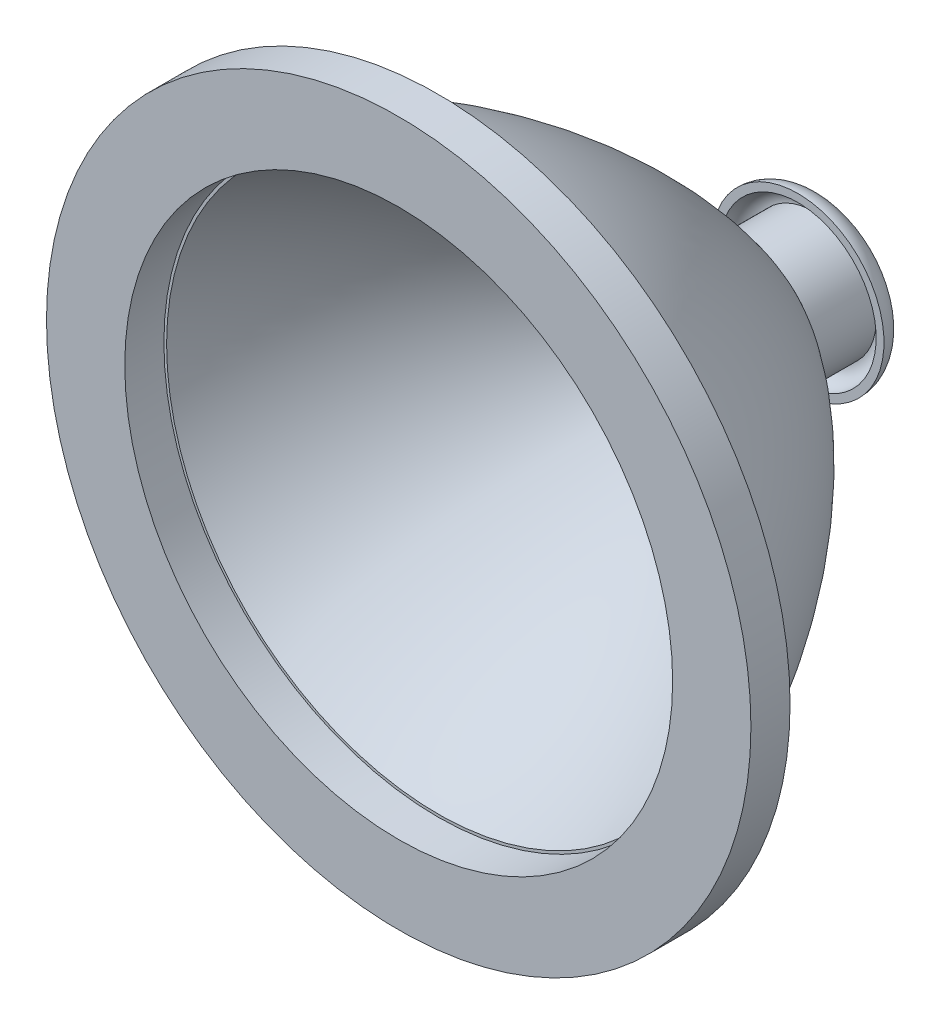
ISO-10303-21;
HEADER;
FILE_DESCRIPTION(('STEP AP214'),'2;1');
FILE_NAME('part.step','',(''),(''),'','','');
FILE_SCHEMA(('AUTOMOTIVE_DESIGN { 1 0 10303 214 1 1 1 1 }'));
ENDSEC;
DATA;
#1=APPLICATION_CONTEXT('core data for automotive mechanical design processes');
#2=APPLICATION_PROTOCOL_DEFINITION('international standard','automotive_design',2000,#1);
#3=PRODUCT_CONTEXT('',#1,'mechanical');
#4=PRODUCT('Part','Part','',(#3));
#5=PRODUCT_RELATED_PRODUCT_CATEGORY('part','',(#4));
#6=PRODUCT_DEFINITION_FORMATION('','',#4);
#7=PRODUCT_DEFINITION_CONTEXT('part definition',#1,'design');
#8=PRODUCT_DEFINITION('design','',#6,#7);
#9=PRODUCT_DEFINITION_SHAPE('','',#8);
#10=(LENGTH_UNIT() NAMED_UNIT(*) SI_UNIT(.MILLI.,.METRE.));
#11=(NAMED_UNIT(*) PLANE_ANGLE_UNIT() SI_UNIT($,.RADIAN.));
#12=(NAMED_UNIT(*) SI_UNIT($,.STERADIAN.) SOLID_ANGLE_UNIT());
#13=UNCERTAINTY_MEASURE_WITH_UNIT(LENGTH_MEASURE(1.E-05),#10,'distance_accuracy_value','');
#14=(GEOMETRIC_REPRESENTATION_CONTEXT(3) GLOBAL_UNCERTAINTY_ASSIGNED_CONTEXT((#13)) GLOBAL_UNIT_ASSIGNED_CONTEXT((#10,
#11,#12)) REPRESENTATION_CONTEXT('',''));
#15=CARTESIAN_POINT('',(0.,0.,0.));
#16=DIRECTION('',(0.,0.,1.));
#17=DIRECTION('',(1.,0.,0.));
#18=AXIS2_PLACEMENT_3D('',#15,#16,#17);
#19=CARTESIAN_POINT('',(0.,0.,-58.42));
#20=DIRECTION('',(0.,0.,-1.));
#21=DIRECTION('',(-1.,0.,0.));
#22=AXIS2_PLACEMENT_3D('',#19,#20,#21);
#23=TOROIDAL_SURFACE('',#22,10.16,3.81);
#24=CARTESIAN_POINT('',(0.,0.,-58.42));
#25=DIRECTION('',(0.,0.,-1.));
#26=DIRECTION('',(-1.,0.,0.));
#27=AXIS2_PLACEMENT_3D('',#24,#25,#26);
#28=CIRCLE('',#27,13.97);
#29=CARTESIAN_POINT('',(-13.97,0.,-58.42));
#30=VERTEX_POINT('',#29);
#31=EDGE_CURVE('E11',#30,#30,#28,.T.);
#32=ORIENTED_EDGE('',*,*,#31,.T.);
#33=EDGE_LOOP('',(#32));
#34=FACE_BOUND('',#33,.T.);
#35=CARTESIAN_POINT('',(0.,0.,-62.23));
#36=DIRECTION('',(0.,0.,-1.));
#37=DIRECTION('',(-1.,0.,0.));
#38=AXIS2_PLACEMENT_3D('',#35,#36,#37);
#39=CIRCLE('',#38,10.16);
#40=CARTESIAN_POINT('',(-10.16,0.,-62.23));
#41=VERTEX_POINT('',#40);
#42=EDGE_CURVE('E61',#41,#41,#39,.T.);
#43=ORIENTED_EDGE('',*,*,#42,.F.);
#44=EDGE_LOOP('',(#43));
#45=FACE_BOUND('',#44,.T.);
#46=ADVANCED_FACE('F47',(#34,#45),#23,.T.);
#47=CARTESIAN_POINT('',(0.,-12.7,-58.42));
#48=DIRECTION('',(0.,0.,-1.));
#49=DIRECTION('',(-1.,0.,0.));
#50=AXIS2_PLACEMENT_3D('',#47,#48,#49);
#51=PLANE('',#50);
#52=ORIENTED_EDGE('',*,*,#31,.F.);
#53=EDGE_LOOP('',(#52));
#54=FACE_BOUND('',#53,.T.);
#55=CARTESIAN_POINT('',(0.,0.,-58.42));
#56=DIRECTION('',(0.,0.,-1.));
#57=DIRECTION('',(-1.,0.,0.));
#58=AXIS2_PLACEMENT_3D('',#55,#56,#57);
#59=CIRCLE('',#58,12.7);
#60=CARTESIAN_POINT('',(-12.7,0.,-58.42));
#61=VERTEX_POINT('',#60);
#62=EDGE_CURVE('E53',#61,#61,#59,.T.);
#63=ORIENTED_EDGE('',*,*,#62,.T.);
#64=EDGE_LOOP('',(#63));
#65=FACE_BOUND('',#64,.T.);
#66=ADVANCED_FACE('F70',(#54,#65),#51,.F.);
#67=CARTESIAN_POINT('',(0.,0.,-58.42));
#68=DIRECTION('',(0.,0.,-1.));
#69=DIRECTION('',(-1.,0.,0.));
#70=AXIS2_PLACEMENT_3D('',#67,#68,#69);
#71=TOROIDAL_SURFACE('',#70,10.16,2.54);
#72=ORIENTED_EDGE('',*,*,#62,.F.);
#73=EDGE_LOOP('',(#72));
#74=FACE_BOUND('',#73,.T.);
#75=CARTESIAN_POINT('',(0.,0.,-60.96));
#76=DIRECTION('',(0.,0.,-1.));
#77=DIRECTION('',(-1.,0.,0.));
#78=AXIS2_PLACEMENT_3D('',#75,#76,#77);
#79=CIRCLE('',#78,10.16);
#80=CARTESIAN_POINT('',(-10.16,0.,-60.96));
#81=VERTEX_POINT('',#80);
#82=EDGE_CURVE('E57',#81,#81,#79,.T.);
#83=ORIENTED_EDGE('',*,*,#82,.T.);
#84=EDGE_LOOP('',(#83));
#85=FACE_BOUND('',#84,.T.);
#86=ADVANCED_FACE('F74',(#74,#85),#71,.F.);
#87=CARTESIAN_POINT('',(0.,0.,-55.88));
#88=DIRECTION('',(0.,0.,-1.));
#89=DIRECTION('',(-1.,0.,0.));
#90=AXIS2_PLACEMENT_3D('',#87,#88,#89);
#91=CYLINDRICAL_SURFACE('',#90,10.16);
#92=ORIENTED_EDGE('',*,*,#82,.F.);
#93=EDGE_LOOP('',(#92));
#94=FACE_BOUND('',#93,.T.);
#95=ORIENTED_EDGE('',*,*,#42,.T.);
#96=EDGE_LOOP('',(#95));
#97=FACE_BOUND('',#96,.T.);
#98=ADVANCED_FACE('F67',(#94,#97),#91,.F.);
#99=CLOSED_SHELL('',(#46,#66,#86,#98));
#100=MANIFOLD_SOLID_BREP('B2',#99);
#101=CARTESIAN_POINT('',(0.,50.8,0.));
#102=DIRECTION('',(0.,0.,-1.));
#103=DIRECTION('',(-1.,0.,0.));
#104=AXIS2_PLACEMENT_3D('',#101,#102,#103);
#105=PLANE('',#104);
#106=CARTESIAN_POINT('',(0.,0.,0.));
#107=DIRECTION('',(0.,0.,-1.));
#108=DIRECTION('',(-1.,0.,0.));
#109=AXIS2_PLACEMENT_3D('',#106,#107,#108);
#110=CIRCLE('',#109,44.0129431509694);
#111=CARTESIAN_POINT('',(-44.0129431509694,0.,0.));
#112=VERTEX_POINT('',#111);
#113=EDGE_CURVE('E112',#112,#112,#110,.F.);
#114=ORIENTED_EDGE('',*,*,#113,.F.);
#115=EDGE_LOOP('',(#114));
#116=FACE_BOUND('',#115,.T.);
#117=CARTESIAN_POINT('',(0.,0.,0.));
#118=DIRECTION('',(0.,0.,1.));
#119=DIRECTION('',(1.,0.,0.));
#120=AXIS2_PLACEMENT_3D('',#117,#118,#119);
#121=CIRCLE('',#120,44.45);
#122=CARTESIAN_POINT('',(44.45,0.,0.));
#123=VERTEX_POINT('',#122);
#124=EDGE_CURVE('E143',#123,#123,#121,.T.);
#125=ORIENTED_EDGE('',*,*,#124,.T.);
#126=EDGE_LOOP('',(#125));
#127=FACE_BOUND('',#126,.T.);
#128=ADVANCED_FACE('F101',(#116,#127),#105,.F.);
#129=CARTESIAN_POINT('',(0.,0.,34.7283102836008));
#130=DIRECTION('',(0.,0.,1.));
#131=DIRECTION('',(1.,0.,0.));
#132=AXIS2_PLACEMENT_3D('',#129,#130,#131);
#133=DEGENERATE_TOROIDAL_SURFACE('',#132,44.680387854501,101.6,.F.);
#134=CARTESIAN_POINT('',(0.,0.,0.));
#135=DIRECTION('',(0.,0.,1.));
#136=DIRECTION('',(1.,0.,0.));
#137=AXIS2_PLACEMENT_3D('',#134,#135,#136);
#138=CIRCLE('',#137,50.8);
#139=CARTESIAN_POINT('',(50.8,0.,0.));
#140=VERTEX_POINT('',#139);
#141=EDGE_CURVE('E46',#140,#140,#138,.T.);
#142=ORIENTED_EDGE('',*,*,#141,.F.);
#143=EDGE_LOOP('',(#142));
#144=FACE_BOUND('',#143,.T.);
#145=CARTESIAN_POINT('',(0.,0.,-50.8));
#146=DIRECTION('',(0.,0.,-1.));
#147=DIRECTION('',(-1.,0.,0.));
#148=AXIS2_PLACEMENT_3D('',#145,#146,#147);
#149=CIRCLE('',#148,10.16);
#150=CARTESIAN_POINT('',(-10.16,0.,-50.8));
#151=VERTEX_POINT('',#150);
#152=EDGE_CURVE('E119',#151,#151,#149,.T.);
#153=ORIENTED_EDGE('',*,*,#152,.F.);
#154=EDGE_LOOP('',(#153));
#155=FACE_BOUND('',#154,.T.);
#156=ADVANCED_FACE('F103',(#144,#155),#133,.F.);
#157=CARTESIAN_POINT('',(0.,0.,34.7283102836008));
#158=DIRECTION('',(0.,0.,1.));
#159=DIRECTION('',(1.,0.,0.));
#160=AXIS2_PLACEMENT_3D('',#157,#158,#159);
#161=DEGENERATE_TOROIDAL_SURFACE('',#160,44.680387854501,95.25,.F.);
#162=ORIENTED_EDGE('',*,*,#113,.T.);
#163=EDGE_LOOP('',(#162));
#164=FACE_BOUND('',#163,.T.);
#165=CARTESIAN_POINT('',(0.,0.,-44.45));
#166=DIRECTION('',(0.,0.,1.));
#167=DIRECTION('',(1.,0.,0.));
#168=AXIS2_PLACEMENT_3D('',#165,#166,#167);
#169=CIRCLE('',#168,8.26635596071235);
#170=CARTESIAN_POINT('',(8.26635596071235,0.,-44.45));
#171=VERTEX_POINT('',#170);
#172=EDGE_CURVE('E108',#171,#171,#169,.T.);
#173=ORIENTED_EDGE('',*,*,#172,.F.);
#174=EDGE_LOOP('',(#173));
#175=FACE_BOUND('',#174,.T.);
#176=ADVANCED_FACE('F174',(#164,#175),#161,.T.);
#177=CARTESIAN_POINT('',(0.,0.,-44.45));
#178=DIRECTION('',(0.,0.,1.));
#179=DIRECTION('',(1.,0.,0.));
#180=AXIS2_PLACEMENT_3D('',#177,#178,#179);
#181=PLANE('',#180);
#182=CARTESIAN_POINT('',(0.,0.,-44.45));
#183=DIRECTION('',(0.,0.,1.));
#184=DIRECTION('',(1.,0.,0.));
#185=AXIS2_PLACEMENT_3D('',#182,#183,#184);
#186=CIRCLE('',#185,7.62);
#187=CARTESIAN_POINT('',(7.62,0.,-44.45));
#188=VERTEX_POINT('',#187);
#189=EDGE_CURVE('E133',#188,#188,#186,.T.);
#190=ORIENTED_EDGE('',*,*,#189,.F.);
#191=EDGE_LOOP('',(#190));
#192=FACE_BOUND('',#191,.T.);
#193=ORIENTED_EDGE('',*,*,#172,.T.);
#194=EDGE_LOOP('',(#193));
#195=FACE_BOUND('',#194,.T.);
#196=ADVANCED_FACE('F179',(#192,#195),#181,.T.);
#197=CARTESIAN_POINT('',(0.,0.,-60.96));
#198=DIRECTION('',(0.,0.,1.));
#199=DIRECTION('',(1.,0.,0.));
#200=AXIS2_PLACEMENT_3D('',#197,#198,#199);
#201=CYLINDRICAL_SURFACE('',#200,10.16);
#202=CARTESIAN_POINT('',(0.,0.,-60.96));
#203=DIRECTION('',(0.,0.,-1.));
#204=DIRECTION('',(-1.,0.,0.));
#205=AXIS2_PLACEMENT_3D('',#202,#203,#204);
#206=CIRCLE('',#205,10.16);
#207=CARTESIAN_POINT('',(-10.16,0.,-60.96));
#208=VERTEX_POINT('',#207);
#209=EDGE_CURVE('E117',#208,#208,#206,.T.);
#210=ORIENTED_EDGE('',*,*,#209,.F.);
#211=EDGE_LOOP('',(#210));
#212=FACE_BOUND('',#211,.T.);
#213=ORIENTED_EDGE('',*,*,#152,.T.);
#214=EDGE_LOOP('',(#213));
#215=FACE_BOUND('',#214,.T.);
#216=ADVANCED_FACE('F182',(#212,#215),#201,.T.);
#217=CARTESIAN_POINT('',(0.,0.,-60.96));
#218=DIRECTION('',(0.,0.,-1.));
#219=DIRECTION('',(-1.,0.,0.));
#220=AXIS2_PLACEMENT_3D('',#217,#218,#219);
#221=PLANE('',#220);
#222=CARTESIAN_POINT('',(0.,0.,-60.96));
#223=DIRECTION('',(0.,0.,1.));
#224=DIRECTION('',(1.,0.,0.));
#225=AXIS2_PLACEMENT_3D('',#222,#223,#224);
#226=CIRCLE('',#225,6.74624);
#227=CARTESIAN_POINT('',(6.74624,0.,-60.96));
#228=VERTEX_POINT('',#227);
#229=EDGE_CURVE('E122',#228,#228,#226,.T.);
#230=ORIENTED_EDGE('',*,*,#229,.T.);
#231=EDGE_LOOP('',(#230));
#232=FACE_BOUND('',#231,.T.);
#233=ORIENTED_EDGE('',*,*,#209,.T.);
#234=EDGE_LOOP('',(#233));
#235=FACE_BOUND('',#234,.T.);
#236=ADVANCED_FACE('F189',(#232,#235),#221,.T.);
#237=CARTESIAN_POINT('',(0.,0.,-44.45));
#238=DIRECTION('',(0.,0.,1.));
#239=DIRECTION('',(1.,0.,0.));
#240=AXIS2_PLACEMENT_3D('',#237,#238,#239);
#241=CYLINDRICAL_SURFACE('',#240,6.74624);
#242=ORIENTED_EDGE('',*,*,#229,.F.);
#243=EDGE_LOOP('',(#242));
#244=FACE_BOUND('',#243,.T.);
#245=CARTESIAN_POINT('',(0.,0.,-49.53));
#246=DIRECTION('',(0.,0.,1.));
#247=DIRECTION('',(1.,0.,0.));
#248=AXIS2_PLACEMENT_3D('',#245,#246,#247);
#249=CIRCLE('',#248,6.74624);
#250=CARTESIAN_POINT('',(6.74624,0.,-49.53));
#251=VERTEX_POINT('',#250);
#252=EDGE_CURVE('E127',#251,#251,#249,.T.);
#253=ORIENTED_EDGE('',*,*,#252,.T.);
#254=EDGE_LOOP('',(#253));
#255=FACE_BOUND('',#254,.T.);
#256=ADVANCED_FACE('F193',(#244,#255),#241,.F.);
#257=CARTESIAN_POINT('',(6.74624,0.,-49.53));
#258=DIRECTION('',(0.,0.,-1.));
#259=DIRECTION('',(-1.,0.,0.));
#260=AXIS2_PLACEMENT_3D('',#257,#258,#259);
#261=PLANE('',#260);
#262=ORIENTED_EDGE('',*,*,#252,.F.);
#263=EDGE_LOOP('',(#262));
#264=FACE_BOUND('',#263,.T.);
#265=CARTESIAN_POINT('',(0.,0.,-49.53));
#266=DIRECTION('',(0.,0.,1.));
#267=DIRECTION('',(1.,0.,0.));
#268=AXIS2_PLACEMENT_3D('',#265,#266,#267);
#269=CIRCLE('',#268,7.62);
#270=CARTESIAN_POINT('',(7.62,0.,-49.53));
#271=VERTEX_POINT('',#270);
#272=EDGE_CURVE('E130',#271,#271,#269,.T.);
#273=ORIENTED_EDGE('',*,*,#272,.T.);
#274=EDGE_LOOP('',(#273));
#275=FACE_BOUND('',#274,.T.);
#276=ADVANCED_FACE('F197',(#264,#275),#261,.F.);
#277=CARTESIAN_POINT('',(0.,0.,-44.45));
#278=DIRECTION('',(0.,0.,1.));
#279=DIRECTION('',(1.,0.,0.));
#280=AXIS2_PLACEMENT_3D('',#277,#278,#279);
#281=CYLINDRICAL_SURFACE('',#280,7.62);
#282=ORIENTED_EDGE('',*,*,#272,.F.);
#283=EDGE_LOOP('',(#282));
#284=FACE_BOUND('',#283,.T.);
#285=ORIENTED_EDGE('',*,*,#189,.T.);
#286=EDGE_LOOP('',(#285));
#287=FACE_BOUND('',#286,.T.);
#288=ADVANCED_FACE('F164',(#284,#287),#281,.F.);
#289=CARTESIAN_POINT('',(0.,0.,0.));
#290=DIRECTION('',(0.,0.,1.));
#291=DIRECTION('',(1.,0.,0.));
#292=AXIS2_PLACEMENT_3D('',#289,#290,#291);
#293=PLANE('',#292);
#294=CARTESIAN_POINT('',(0.,0.,0.));
#295=DIRECTION('',(0.,0.,1.));
#296=DIRECTION('',(1.,0.,0.));
#297=AXIS2_PLACEMENT_3D('',#294,#295,#296);
#298=CIRCLE('',#297,57.15);
#299=CARTESIAN_POINT('',(57.15,0.,0.));
#300=VERTEX_POINT('',#299);
#301=EDGE_CURVE('E137',#300,#300,#298,.T.);
#302=ORIENTED_EDGE('',*,*,#301,.F.);
#303=EDGE_LOOP('',(#302));
#304=FACE_BOUND('',#303,.T.);
#305=ORIENTED_EDGE('',*,*,#141,.T.);
#306=EDGE_LOOP('',(#305));
#307=FACE_BOUND('',#306,.T.);
#308=ADVANCED_FACE('F155',(#304,#307),#293,.F.);
#309=CARTESIAN_POINT('',(0.,0.,6.35));
#310=DIRECTION('',(0.,0.,1.));
#311=DIRECTION('',(1.,0.,0.));
#312=AXIS2_PLACEMENT_3D('',#309,#310,#311);
#313=PLANE('',#312);
#314=CARTESIAN_POINT('',(0.,0.,6.35));
#315=DIRECTION('',(0.,0.,1.));
#316=DIRECTION('',(1.,0.,0.));
#317=AXIS2_PLACEMENT_3D('',#314,#315,#316);
#318=CIRCLE('',#317,57.15);
#319=CARTESIAN_POINT('',(57.15,0.,6.35));
#320=VERTEX_POINT('',#319);
#321=EDGE_CURVE('E136',#320,#320,#318,.T.);
#322=ORIENTED_EDGE('',*,*,#321,.T.);
#323=EDGE_LOOP('',(#322));
#324=FACE_BOUND('',#323,.T.);
#325=CARTESIAN_POINT('',(0.,0.,6.35));
#326=DIRECTION('',(0.,0.,1.));
#327=DIRECTION('',(1.,0.,0.));
#328=AXIS2_PLACEMENT_3D('',#325,#326,#327);
#329=CIRCLE('',#328,44.45);
#330=CARTESIAN_POINT('',(44.45,0.,6.35));
#331=VERTEX_POINT('',#330);
#332=EDGE_CURVE('E140',#331,#331,#329,.T.);
#333=ORIENTED_EDGE('',*,*,#332,.F.);
#334=EDGE_LOOP('',(#333));
#335=FACE_BOUND('',#334,.T.);
#336=ADVANCED_FACE('F152',(#324,#335),#313,.T.);
#337=CARTESIAN_POINT('',(0.,0.,6.35));
#338=DIRECTION('',(0.,0.,-1.));
#339=DIRECTION('',(-1.,0.,0.));
#340=AXIS2_PLACEMENT_3D('',#337,#338,#339);
#341=CYLINDRICAL_SURFACE('',#340,57.15);
#342=ORIENTED_EDGE('',*,*,#321,.F.);
#343=EDGE_LOOP('',(#342));
#344=FACE_BOUND('',#343,.T.);
#345=ORIENTED_EDGE('',*,*,#301,.T.);
#346=EDGE_LOOP('',(#345));
#347=FACE_BOUND('',#346,.T.);
#348=ADVANCED_FACE('F154',(#344,#347),#341,.T.);
#349=CARTESIAN_POINT('',(0.,0.,6.35));
#350=DIRECTION('',(0.,0.,-1.));
#351=DIRECTION('',(-1.,0.,0.));
#352=AXIS2_PLACEMENT_3D('',#349,#350,#351);
#353=CYLINDRICAL_SURFACE('',#352,44.45);
#354=ORIENTED_EDGE('',*,*,#332,.T.);
#355=EDGE_LOOP('',(#354));
#356=FACE_BOUND('',#355,.T.);
#357=ORIENTED_EDGE('',*,*,#124,.F.);
#358=EDGE_LOOP('',(#357));
#359=FACE_BOUND('',#358,.T.);
#360=ADVANCED_FACE('F149',(#356,#359),#353,.F.);
#361=CLOSED_SHELL('',(#128,#156,#176,#196,#216,#236,#256,#276,#288,#308,#336,#348,#360));
#362=MANIFOLD_SOLID_BREP('B6',#361);
#363=ADVANCED_BREP_SHAPE_REPRESENTATION('',(#18,#100,#362),#14);
#364=SHAPE_DEFINITION_REPRESENTATION(#9,#363);
ENDSEC;
END-ISO-10303-21;
